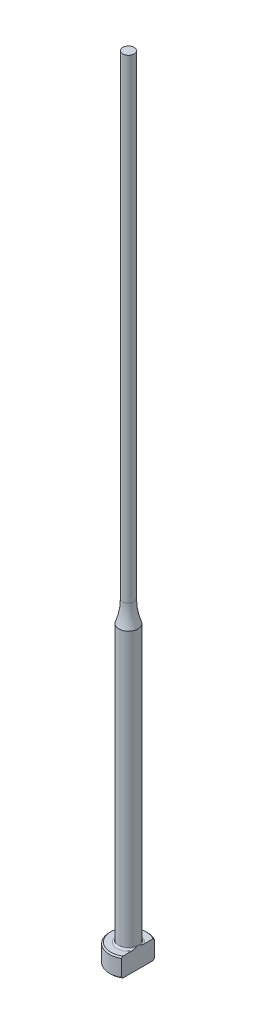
from build123d import *
from build123d.topology import SkipClean

# Parameters (mm, degrees)
CHAMFER1_SIZE = 0.2
FILLET1_R     = 0.3
KEY_DEPTH     = 126.071979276


with BuildPart() as part:
    # Sketch1 → Revolve1 (revolve)
    with BuildSketch(Plane.XY, mode=Mode.PRIVATE) as revolve1_sk:
        with BuildLine():
            Line((0, 0), (-3, 0))
            Line((-3, 0), (-3, 3))
            Line((-3, 3), (-1.5, 3))
            Line((-1.5, 3), (-1.5, 46.588255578))
            ThreePointArc((-1.5, 46.588255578), (-1.051142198, 48.267949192), (-0.9, 50))
            Line((-0.9, 50), (-0.9, 125))
            Line((-0.9, 125), (0, 125))
            Line((0, 125), (0, 0))
        make_face()
    revolve(revolve1_sk.sketch.rotate(Axis((0, 259.958771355, 0), (0, -1, 0)), 270), axis=Axis((0, 259.958771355, 0), (0, -1, 0)))

    # Chamfer1
    chamfer1_edges = [part.edges().sort_by_distance(p)[0] for p in [
        (0, 0, -3),
        (0, 3, -3),
    ]]
    chamfer(chamfer1_edges, length=CHAMFER1_SIZE)

    # Fillet1
    fillet1_edges = [part.edges().sort_by_distance(p)[0] for p in [
        (0, 3, -1.5),
    ]]
    fillet(fillet1_edges, radius=FILLET1_R)

    # Sketch2 → KEY (cut, through all)
    with SkipClean():  # the faces are left unmerged after this step: merging them gives an invalid solid
        with BuildSketch(Plane(origin=(0, 0, 0), x_dir=(1, 0, 0), z_dir=(0, 1, 0))):
            with BuildLine():
                Line((1.5, 2.598076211), (1.5, -2.598076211))
                ThreePointArc((1.5, -2.598076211), (3, 0), (1.5, 2.598076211))
            make_face()
        extrude(amount=KEY_DEPTH, mode=Mode.SUBTRACT)


solid = part.part
